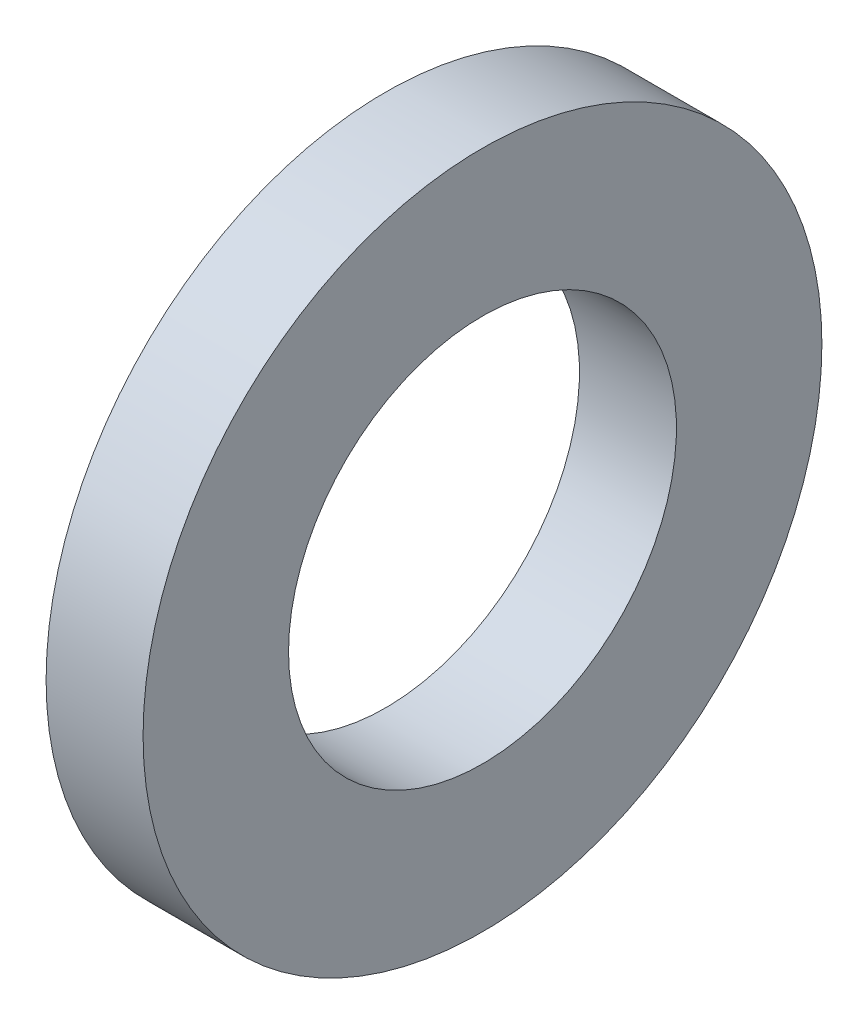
from build123d import *

# Parameters (mm, degrees)
ESQUISSE1_W = 2
ESQUISSE1_H = 3


with BuildPart() as part:
    # Esquisse1 → Base-R_volution (revolve)
    with BuildSketch(Plane.XY, mode=Mode.PRIVATE) as base_r_volution_sk:
        with Locations((1, 5.5)):
            Rectangle(ESQUISSE1_W, ESQUISSE1_H)
    revolve(base_r_volution_sk.sketch.rotate(Axis((-12.574722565, 0, 0), (1, 0, 0)), 90), axis=Axis((-12.574722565, 0, 0), (1, 0, 0)))


solid = part.part
